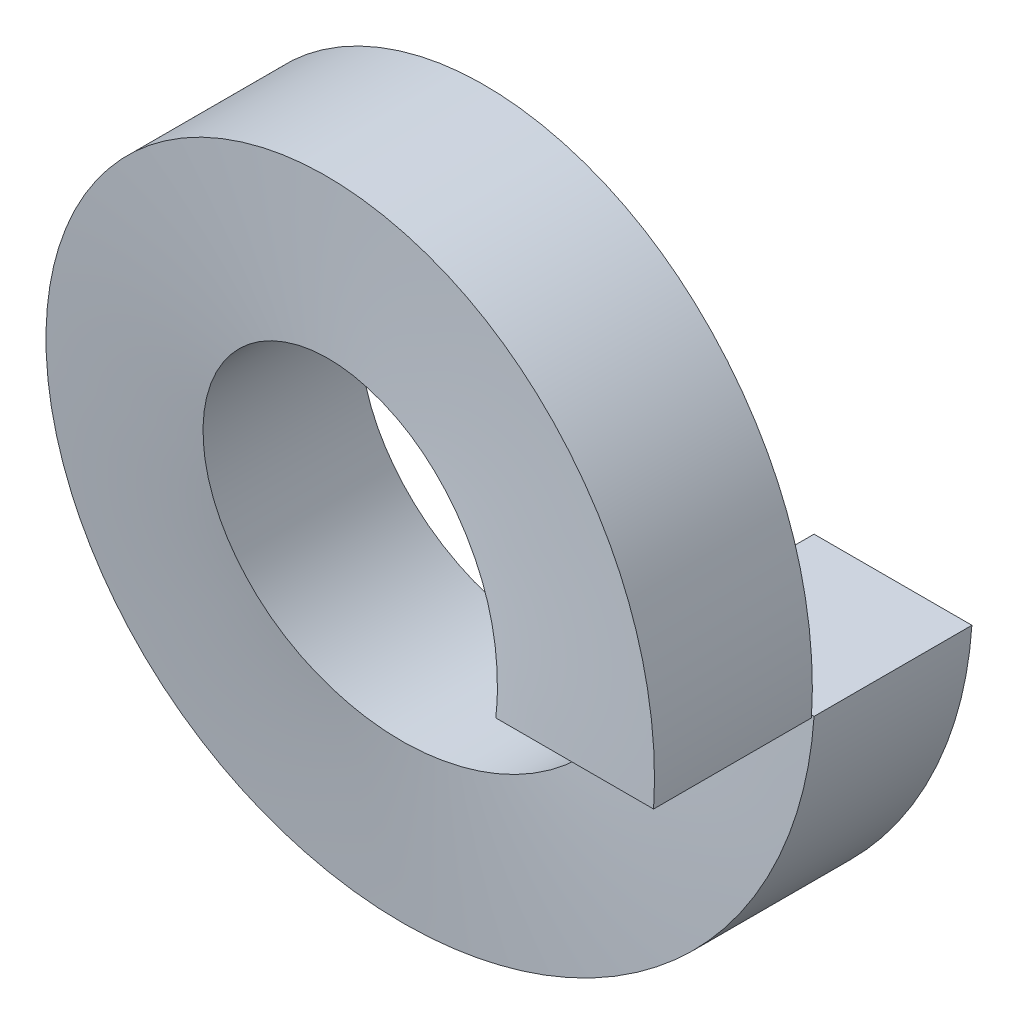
from build123d import *

# Parameters (mm, degrees)
SWEEP_1_PITCH  = 1.85
SWEEP_1_HEIGHT = 1.85
SWEEP_1_RADIUS = 3.05
SKETCH_2_W     = 1.82
SKETCH_2_H     = 1.82


with BuildPart() as part:
    # Sweep 1: sweep along a helix
    with BuildLine() as sweep_1_path:
        Helix(SWEEP_1_PITCH, SWEEP_1_HEIGHT, SWEEP_1_RADIUS, center=(0, 0, 0), direction=(0, 0, 1), lefthand=True)
    # Sketch 2 → Sweep 1 (sweep)
    with BuildSketch(Plane(origin=(0, 0, 0), x_dir=(1, 0, 0), z_dir=(0, 1, 0))):
        with Locations((3.05, 0)):
            Rectangle(SKETCH_2_W, SKETCH_2_H)
    sweep(path=sweep_1_path.line, is_frenet=True)


solid = part.part
